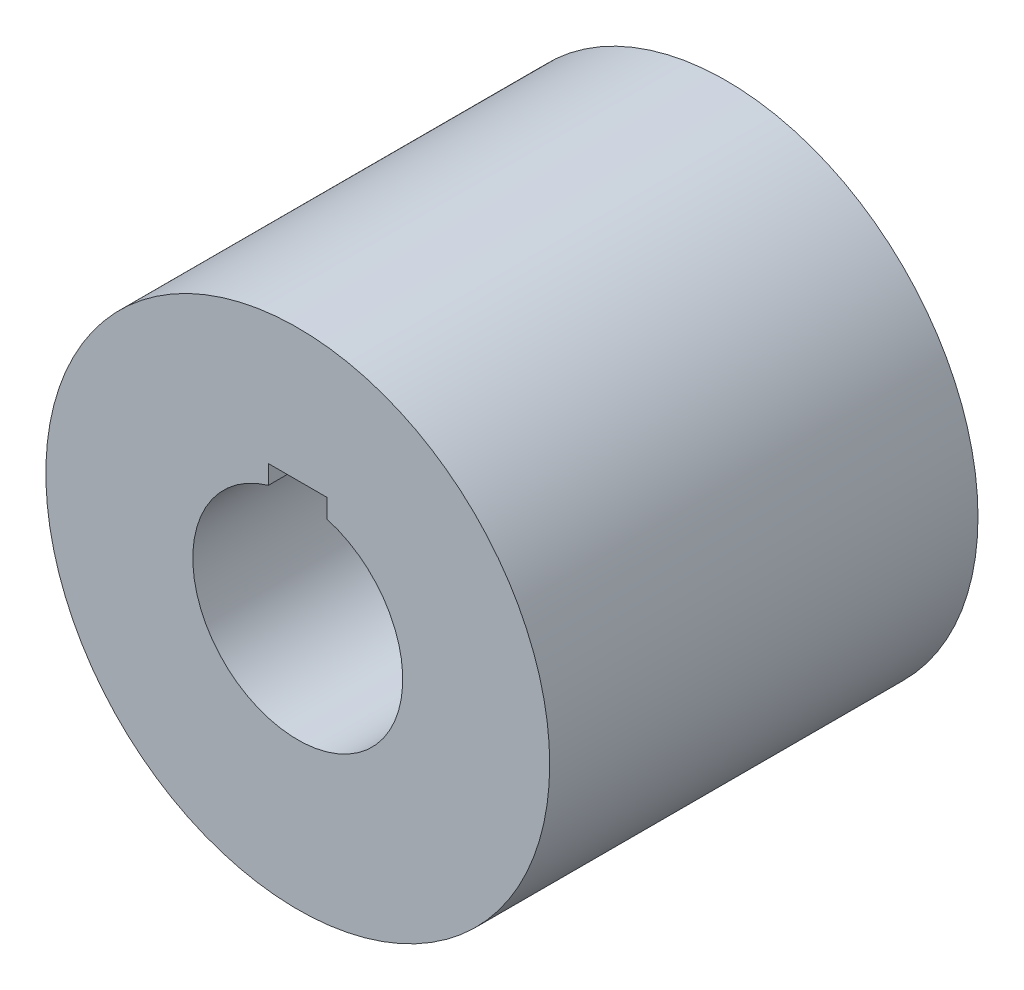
from build123d import *

# Parameters (mm, degrees)
ESQUISSE1_R             = 60
EXTRUSION1_DEPTH        = 51
ENL_V_MAT_EXTRU_1_DEPTH = 133.680066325


with BuildPart() as part:
    # Esquisse1 → Extrusion1 (new, symmetric)
    with BuildSketch(Plane.XY):
        Circle(ESQUISSE1_R)
    extrude(amount=EXTRUSION1_DEPTH, both=True)

    # Esquisse2 → Enl_v. mat.-Extru.1 (cut, through all)
    with BuildSketch(Plane.XY.offset(51)):
        with BuildLine():
            Line((7, 28.5), (-7, 28.5))
            Line((-7, 28.5), (-7, 24))
            ThreePointArc((-7, 24), (0, -25), (7, 24))
            Line((7, 24), (7, 28.5))
        make_face()
    extrude(amount=-ENL_V_MAT_EXTRU_1_DEPTH, mode=Mode.SUBTRACT)


solid = part.part
